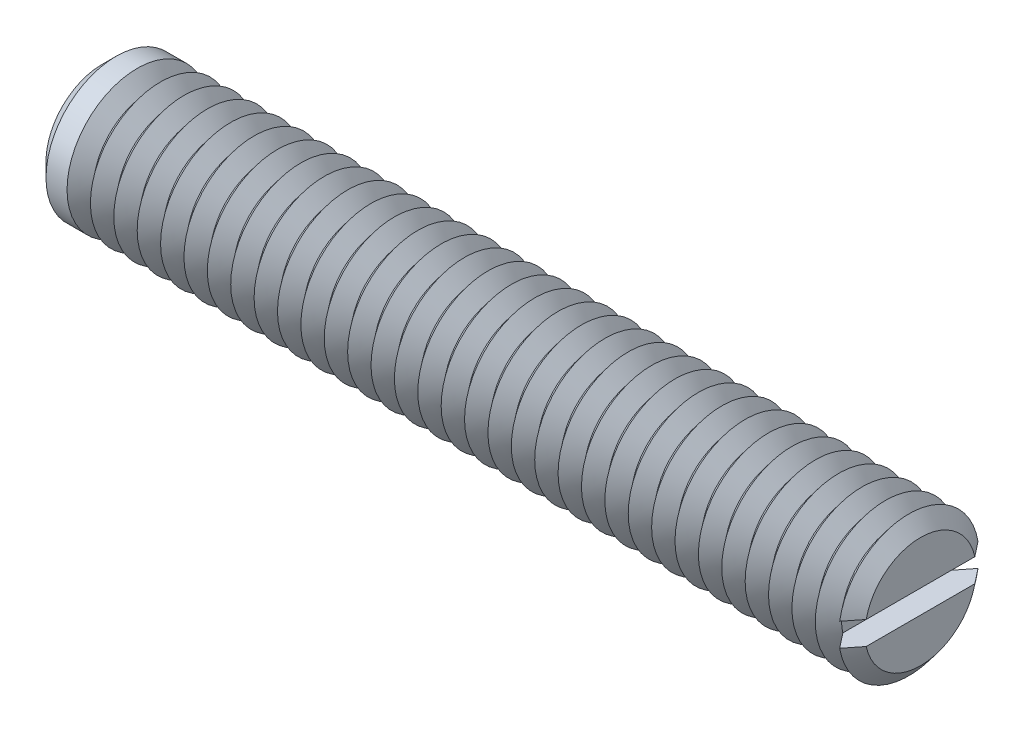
from build123d import *

# Parameters (mm, degrees)
SKETCH1_R       = 3
EXTRUDE1_DEPTH  = 17.5
SKETCH2_W       = 1
SKETCH2_H       = 1
EXTRUDE2_DEPTH  = 4.5
CHAMFER1_SIZE   = 0.6
LPATTERN1_COUNT = 34
LPATTERN1_PITCH = 1


with BuildPart() as part:
    # Sketch1 → Extrude1 (new, symmetric)
    with BuildSketch(Plane(origin=(0, 0, 0), x_dir=(0, 0, -1), z_dir=(1, 0, 0))):
        Circle(SKETCH1_R)
    extrude(amount=EXTRUDE1_DEPTH, both=True)

    # Sketch2 → Extrude2 (cut, symmetric)
    with BuildSketch(Plane.XY):
        with Locations((17, 0)):
            Rectangle(SKETCH2_W, SKETCH2_H)
    extrude(amount=EXTRUDE2_DEPTH, both=True, mode=Mode.SUBTRACT)

    # Chamfer1
    chamfer1_edges = [part.edges().sort_by_distance(p)[0] for p in [
        (-17.5, 0, 3),
    ]]
    chamfer(chamfer1_edges, length=CHAMFER1_SIZE)

    # Sketch3 → Cut-Revolve1 (revolve, cut)
    with BuildSketch(Plane.XY, mode=Mode.PRIVATE) as cut_revolve1_sk:
        Polygon((17, -3), (18, -3), (17.5, -2.3755002), align=None)
    cut_revolve1 = revolve(cut_revolve1_sk.sketch.rotate(Axis((0, 0, 0), (1, 0, 0)), 260.405931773), axis=Axis((0, 0, 0), (1, 0, 0)), mode=Mode.SUBTRACT)

    # LPattern1: Cut-Revolve1 ×34
    with Locations(*[(-i * LPATTERN1_PITCH, 0, 0) for i in range(1, LPATTERN1_COUNT)]):
        add(cut_revolve1, mode=Mode.SUBTRACT)


solid = part.part
